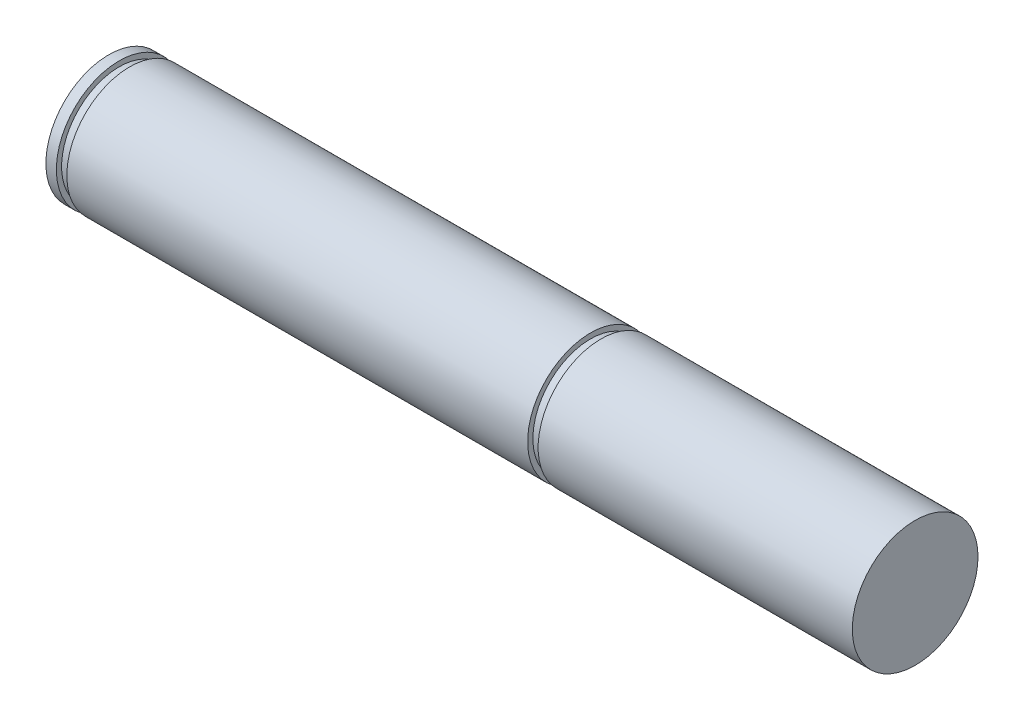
from build123d import *

# Parameters (mm, degrees)
SKETCH_1_R      = 6
EXTRUDE_1_DEPTH = 1
SKETCH_3_R      = 5.5
EXTRUDE_2_DEPTH = 1
SKETCH_4_R      = 6
EXTRUDE_3_DEPTH = 44
SKETCH_5_R      = 5.5
EXTRUDE_4_DEPTH = 1
SKETCH_6_R      = 6
EXTRUDE_5_DEPTH = 30


with BuildPart() as part:
    # Sketch 1 → Extrude 1 (new body)
    with BuildSketch(Plane(origin=(0, 0, 0), x_dir=(0, 0, -1), z_dir=(1, 0, 0))):
        Circle(SKETCH_1_R)
    extrude(amount=EXTRUDE_1_DEPTH)

    # Sketch 3 → Extrude 2 (add)
    with BuildSketch(Plane(origin=(1, 0, 0), x_dir=(0, 0, -1), z_dir=(1, 0, 0))):
        Circle(SKETCH_3_R)
    extrude(amount=EXTRUDE_2_DEPTH)

    # Sketch 4 → Extrude 3 (add)
    with BuildSketch(Plane(origin=(2, 0, 0), x_dir=(0, 0, -1), z_dir=(1, 0, 0))):
        Circle(SKETCH_4_R)
    extrude(amount=EXTRUDE_3_DEPTH)

    # Sketch 5 → Extrude 4 (add)
    with BuildSketch(Plane(origin=(46, 0, 0), x_dir=(0, 0, -1), z_dir=(1, 0, 0))):
        Circle(SKETCH_5_R)
    extrude(amount=EXTRUDE_4_DEPTH)

    # Sketch 6 → Extrude 5 (add)
    with BuildSketch(Plane(origin=(47, 0, 0), x_dir=(0, 0, -1), z_dir=(1, 0, 0))):
        Circle(SKETCH_6_R)
    extrude(amount=EXTRUDE_5_DEPTH)


solid = part.part
